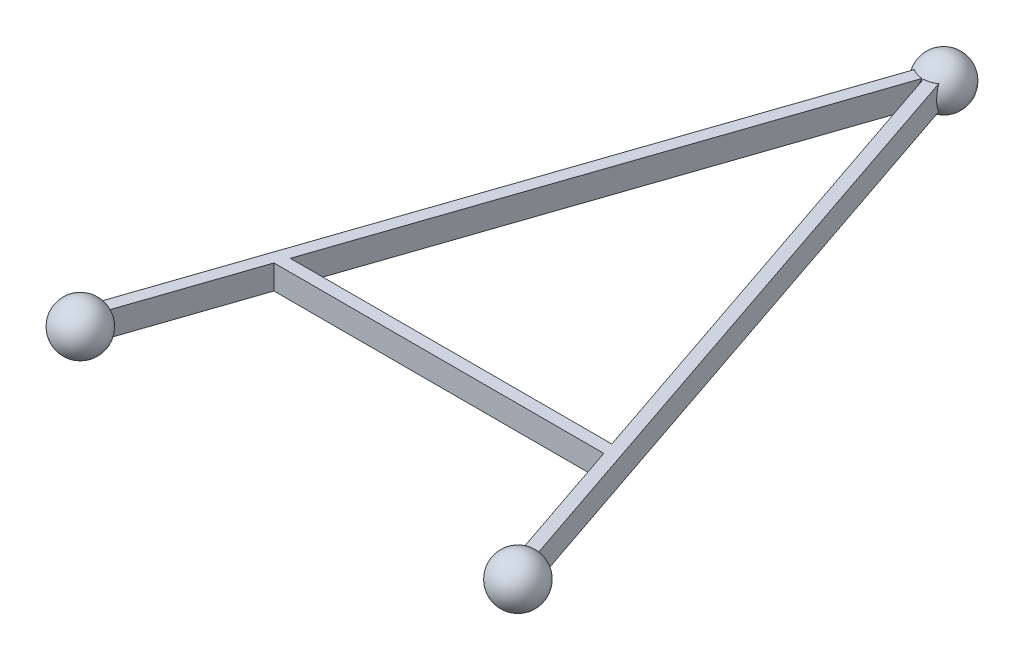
from build123d import *

# Parameters (mm, degrees)
EXTRUDE3_REACH      = 426.839
EXTRUDE3_END_RADIUS = 12.7
SKETCH8_W           = 6.35
SKETCH8_H           = 12.7
EXTRUDE4_REACH      = 426.839
EXTRUDE4_END_RADIUS = 12.7
SKETCH9_W           = 6.35
SKETCH9_H           = 12.7
EXTRUDE5_REACH      = 350.178
SKETCH10_W          = 6.35
SKETCH10_H          = 12.7


with BuildPart() as part:
    # Sketch3 → Revolve1 (revolve)
    with BuildSketch(Plane.XY):
        with BuildLine():
            Line((-228.6, 12.7), (-228.6, -12.7))
            ThreePointArc((-228.6, -12.7), (-215.9, 0), (-228.6, 12.7))
        make_face()
    revolve(axis=Axis((-228.6, 19.081718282, 0), (0, -1, 0)))



with BuildPart() as body_2:
    # Sketch4 → Revolve2 (revolve)
    with BuildSketch(Plane.XY):
        with BuildLine():
            Line((0, 12.7), (0, -12.7))
            ThreePointArc((0, -12.7), (-12.7, 0), (0, 12.7))
        make_face()
    revolve(axis=Axis((0, 22.794871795, 0), (0, -1, 0)))


with BuildPart() as body_3:
    # Sketch7 → Revolve3 (revolve)
    with BuildSketch(Plane(origin=(0, 0, 0), x_dir=(-0.32142857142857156, 0, -0.9469338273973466), z_dir=(0.9469338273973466, 0, -0.32142857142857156))):
        with BuildLine():
            Line((355.6, 12.7), (355.6, -12.7))
            ThreePointArc((355.6, -12.7), (342.9, 0), (355.6, 12.7))
        make_face()
    revolve(axis=Axis((-114.3, -33.24079005, -336.729669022), (0, 1, 0)))


with BuildPart() as part_1:
    add(part.part)

    add(body_3.part)  # Extrude3 merges body 3
    # Extrude3: up to this sphere (the profile starts outside it)
    extrude3_end = Location((-114.3, 0, -336.729669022)) * Sphere(EXTRUDE3_END_RADIUS, mode=Mode.PRIVATE)
    # Sketch8 → Extrude3 (add, up to the surface)
    with BuildSketch(Plane(origin=(-228.6, 0, 0), x_dir=(0.9469338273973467, 0, 0.32142857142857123), z_dir=(-0.32142857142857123, 0, 0.9469338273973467)), mode=Mode.PRIVATE) as extrude3_sk1:
        Rectangle(SKETCH8_W, SKETCH8_H)
    extrude3_tool1 = extrude(extrude3_sk1.sketch, amount=-EXTRUDE3_REACH, mode=Mode.PRIVATE) - extrude3_end
    add(extrude3_tool1.solids().sort_by_distance((-228.6, 0, 0))[0])


    add(body_2.part)  # Extrude4 merges body 2
    # Extrude4: up to this sphere (the profile starts outside it)
    extrude4_end = Location((-114.3, 0, -336.729669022)) * Sphere(EXTRUDE4_END_RADIUS, mode=Mode.PRIVATE)
    # Sketch9 → Extrude4 (add, up to the surface)
    with BuildSketch(Plane(origin=(0, 0, 0), x_dir=(-0.9469338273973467, 0, 0.3214285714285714), z_dir=(-0.3214285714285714, 0, -0.9469338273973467)), mode=Mode.PRIVATE) as extrude4_sk1:
        Rectangle(SKETCH9_W, SKETCH9_H)
    extrude4_tool1 = extrude(extrude4_sk1.sketch, amount=EXTRUDE4_REACH, mode=Mode.PRIVATE) - extrude4_end
    add(extrude4_tool1.solids().sort_by_distance((0, 0, 0))[0])

    # Extrude5: up to this plane
    extrude5_end = Plane(origin=(-94.306384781, 6.35, -385.753408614), z_dir=(0.9469338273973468, 0, 0.3214285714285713))
    # Sketch10 → Extrude5 (add, up to the surface)
    with BuildSketch(Plane(origin=(-25.865436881, 0, -76.2), x_dir=(0, 0, -1), z_dir=(1, 0, 0)), mode=Mode.PRIVATE) as extrude5_sk1:
        Rectangle(SKETCH10_W, SKETCH10_H)
    extrude5_tool1 = split(extrude(extrude5_sk1.sketch, amount=-EXTRUDE5_REACH, mode=Mode.PRIVATE), bisect_by=extrude5_end, keep=Keep.BOTH, mode=Mode.PRIVATE)
    add(extrude5_tool1.solids().sort_by_distance((-25.865437, 0, -76.2))[0])


solid = part_1.part
